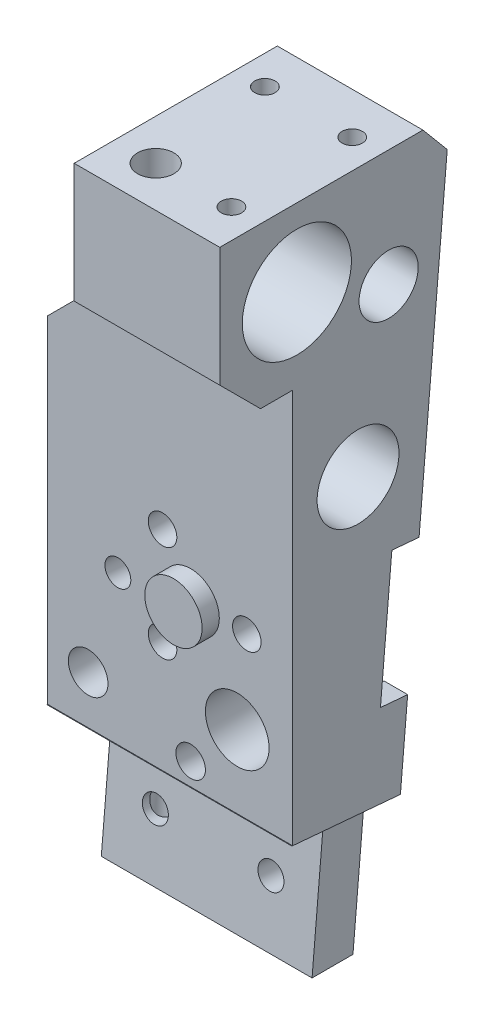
from build123d import *

# Parameters (mm, degrees)
SKETCH1_W                                           = 21.3868
SKETCH1_H                                           = 62.23
EXTRUDE1_DEPTH                                      = 13.716
CUT_EXTRUDE2_DEPTH                                  = 40.077480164
CUT_EXTRUDE2_DEPTH_BACK                             = 40.077480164
CUT_EXTRUDE3_DEPTH                                  = 40.077480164
CUT_EXTRUDE3_DEPTH_BACK                             = 40.077480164
CUT_EXTRUDE4_START                                  = -3
CUT_EXTRUDE4_DEPTH                                  = 3
CUT_EXTRUDE5_DEPTH                                  = 43.758328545
SKETCH10_W                                          = 21.3868
SKETCH10_H                                          = 13.97
EXTRUDE2_DEPTH                                      = 6.35
SKETCH13_R                                          = 1.4986
CUT_EXTRUDE9_DEPTH                                  = 46.197238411
SKETCH20_W                                          = 8.6868
SKETCH20_H                                          = 20.066
CUT_EXTRUDE10_DEPTH                                 = 13.97
SKETCH21_R                                          = 4.75869
CUT_EXTRUDE11_DEPTH                                 = 42.793362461
F_5_40_TAPPED_HOLE1_D                               = 2.5781
F_5_40_TAPPED_HOLE1_DEPTH                           = 10.033
F_5_40_TAPPED_HOLE1_TIP                             = 0.774539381
F_4_40_TAPPED_HOLE1_D                               = 2.2606
SKETCH26_R                                          = 2.50063
EXTRUDE4_DEPTH                                      = 1.5
CBORE_FOR_3_FILLISTER_HEAD_MACHINE_SCRE_D           = 2.4892
CBORE_FOR_3_FILLISTER_HEAD_MACHINE_SCRE_CBORE_D     = 4.4704
CBORE_FOR_3_FILLISTER_HEAD_MACHINE_SCRE_CBORE_DEPTH = 10.668
F_4_40_TAPPED_HOLE2_D                               = 2.2606
F_1_8_0_125_DIAMETER_HOLE1_D                        = 3.16738
F_1_8_0_125_DIAMETER_HOLE1_DEPTH                    = 4.572
F_2_56_TAPPED_HOLE1_D                               = 1.778
F_2_56_TAPPED_HOLE1_DEPTH                           = 3.9116
F_2_56_TAPPED_HOLE1_TIP                             = 0.53416509
F_8_32_TAPPED_HOLE1_D                               = 3.4544
EXTRUDE5_DEPTH                                      = 0.635
SKETCH44_W                                          = 21.3868
SKETCH44_H                                          = 0.632583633
CUT_EXTRUDE12_DEPTH                                 = 40.077480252
F_9_32_0_28125_DIAMETER_HOLE1_D                     = 7.14375
F_13_64_0_20313_DIAMETER_HOLE1_D                    = 5.159502
CHAMFER1_SIZE                                       = 5.08
CHAMFER2_SIZE                                       = 2.54
CHAMFER2_SIZE2                                      = 2.34457836
CHAMFER3_SIZE                                       = 3.556
CUT_EXTRUDE13_DEPTH                                 = 46.197238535
SKETCH58_R                                          = 2.77876
CUT_EXTRUDE14_DEPTH                                 = 40.000329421
SKETCH61_R                                          = 1.143
CUT_EXTRUDE15_DEPTH                                 = 0.381
F_4_40_TAPPED_HOLE5_D                               = 2.2606
F_4_40_TAPPED_HOLE5_DEPTH                           = 13.9446
F_4_40_TAPPED_HOLE5_TIP                             = 0.679152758


with BuildPart() as part:
    # Sketch1 → Extrude1 (new body)
    with BuildSketch(Plane.XY):
        with Locations((-1.8034, 3.27614406)):
            Rectangle(SKETCH1_W, SKETCH1_H)
    extrude(amount=EXTRUDE1_DEPTH)

    # Sketch2 → Cut-Extrude2 (cut, two sides: drawn at the far end of the back side and taken through both)
    with BuildSketch(Plane(origin=(0, 0, 0), x_dir=(0, 0, -1), z_dir=(1, 0, 0)).offset(-CUT_EXTRUDE2_DEPTH_BACK)):
        Polygon((0, 34.39114406), (0, -27.83885594), (-5.444419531, -27.83885594), align=None)
    extrude(amount=CUT_EXTRUDE2_DEPTH + CUT_EXTRUDE2_DEPTH_BACK, mode=Mode.SUBTRACT)

    # Sketch4 → Cut-Extrude3 (cut, two sides: drawn at the far end of the back side and taken through both)
    with BuildSketch(Plane(origin=(0, 0, 0), x_dir=(0, 0, -1), z_dir=(1, 0, 0)).offset(-CUT_EXTRUDE3_DEPTH_BACK)):
        Polygon((-9.014002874, -27.83885594), (-13.716, -27.83885594), (-13.716, -13.36085594), (-7.792680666, -13.879079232), align=None)
    extrude(amount=CUT_EXTRUDE3_DEPTH + CUT_EXTRUDE3_DEPTH_BACK, mode=Mode.SUBTRACT)

    # Sketch9 → Cut-Extrude4 (cut)
    with BuildSketch(Plane(origin=(8.89, 0, 0), x_dir=(0, 0, -1), z_dir=(1, 0, 0)).offset(CUT_EXTRUDE4_START)):
        Polygon((-5.444419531, -27.83885594), (-9.014002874, -27.83885594), (-7.792680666, -13.879079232), (-4.25021232, -14.189005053), align=None)
    extrude(amount=CUT_EXTRUDE4_DEPTH, mode=Mode.SUBTRACT)

    # Sketch8 → Cut-Extrude5 (cut, through all)
    with BuildSketch(Plane.ZY.offset(12.4968)):
        Polygon((3.673414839, -7.596179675), (2.677224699, 3.790325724), (5.049413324, 3.997865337), (6.045603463, -7.388640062), align=None)
    extrude(amount=-CUT_EXTRUDE5_DEPTH, mode=Mode.SUBTRACT)

    # Sketch10 → Extrude2 (add)
    with BuildSketch(Plane.XY.offset(13.716)):
        with Locations((-1.8034, 27.40614406)):
            Rectangle(SKETCH10_W, SKETCH10_H)
    extrude(amount=EXTRUDE2_DEPTH)

    # Sketch13 → Cut-Extrude9 (cut, through all)
    with BuildSketch(Plane(origin=(8.89, 0, 0), x_dir=(0, 0, -1), z_dir=(1, 0, 0))):
        with Locations(Location((-13.338597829, 27.646431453, 0), (0, 0, 90))):
            Circle(SKETCH13_R)
    extrude(amount=-CUT_EXTRUDE9_DEPTH, mode=Mode.SUBTRACT)

    # Sketch20 → Cut-Extrude10 (cut)
    with BuildSketch(Plane(origin=(0, 34.39114406, 0), x_dir=(-1, 0, 0), z_dir=(0, 1, 0))):
        with Locations((8.1534, 10.033)):
            Rectangle(SKETCH20_W, SKETCH20_H)
    extrude(amount=-CUT_EXTRUDE10_DEPTH, mode=Mode.SUBTRACT)

    # Sketch21 → Cut-Extrude11 (cut, through all)
    with BuildSketch(Plane.ZY.offset(3.81)):
        with Locations((13.338597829, 27.646431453)):
            Circle(SKETCH21_R)
    extrude(amount=-CUT_EXTRUDE11_DEPTH, mode=Mode.SUBTRACT)

    # 5-40 Tapped Hole1
    with Locations(Plane(origin=(0, 0.261239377, 2.985979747), x_dir=(-1, 0, 0), z_dir=(0, -0.08715574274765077, -0.9961946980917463))):
        with Locations((0, 16.792566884), (0, -13.207433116)):
            Hole(F_5_40_TAPPED_HOLE1_D / 2, depth=F_5_40_TAPPED_HOLE1_DEPTH)
            with Locations((0, 0, -(F_5_40_TAPPED_HOLE1_DEPTH + F_5_40_TAPPED_HOLE1_TIP / 2))):  # 118° drill point
                Cone(0, F_5_40_TAPPED_HOLE1_D / 2, F_5_40_TAPPED_HOLE1_TIP, mode=Mode.SUBTRACT)

    # 4-40 Tapped Hole1 (through all)
    with Locations(Plane(origin=(0, 0.571165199, 6.528448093), x_dir=(1, 0, 0), z_dir=(0, 0.08715574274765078, 0.9961946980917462))):
        with Locations((-8.258, -23.033098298), (1.826, -23.033098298)):
            Hole(F_4_40_TAPPED_HOLE1_D / 2)

    # Sketch26 → Extrude4 (add)
    with BuildSketch(Plane.XY.offset(13.716)):
        Circle(SKETCH26_R)
    extrude(amount=EXTRUDE4_DEPTH)

    # CBORE for _3 Fillister Head Machine Scre (through all)
    with Locations(Plane(origin=(0, 0, 0), x_dir=(1, 0, 0), z_dir=(0, 0, -1))):
        with Locations((-2.45, 4.243524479), (-2.45, -4.243524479), (4.9, 0)):
            CounterBoreHole(CBORE_FOR_3_FILLISTER_HEAD_MACHINE_SCRE_D / 2, CBORE_FOR_3_FILLISTER_HEAD_MACHINE_SCRE_CBORE_D / 2, CBORE_FOR_3_FILLISTER_HEAD_MACHINE_SCRE_CBORE_DEPTH)

    # 4-40 Tapped Hole2 (through all)
    with Locations(Plane(origin=(0, 0.46877899, 5.358168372), x_dir=(-1, 0, 0), z_dir=(0, -0.08715574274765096, -0.9961946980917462))):
        with Locations((6.35, -2.172433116)):
            Hole(F_4_40_TAPPED_HOLE2_D / 2)

    # 1_8 _0.125_ Diameter Hole1
    with Locations(Plane(origin=(0, 34.39114406, 0), x_dir=(-1, 0, 0), z_dir=(0, 1, 0))):
        with Locations((0.254, 16.51)):
            Hole(F_1_8_0_125_DIAMETER_HOLE1_D / 2, depth=F_1_8_0_125_DIAMETER_HOLE1_DEPTH)

    # 2-56 Tapped Hole1
    with Locations(Plane(origin=(0, 34.39114406, 0), x_dir=(-1, 0, 0), z_dir=(0, 1, 0))):
        with Locations((1.27, 5.969), (-6.35, 5.969), (-6.35, 16.51)):
            Hole(F_2_56_TAPPED_HOLE1_D / 2, depth=F_2_56_TAPPED_HOLE1_DEPTH)
            with Locations((0, 0, -(F_2_56_TAPPED_HOLE1_DEPTH + F_2_56_TAPPED_HOLE1_TIP / 2))):  # 118° drill point
                Cone(0, F_2_56_TAPPED_HOLE1_D / 2, F_2_56_TAPPED_HOLE1_TIP, mode=Mode.SUBTRACT)

    # 8-32 Tapped Hole1 (through all)
    with Locations(Plane.XY.offset(13.716)):
        with Locations((-8.9408, -9.80485594)):
            Hole(F_8_32_TAPPED_HOLE1_D / 2)

    # Sketch43 → Extrude5 (add)
    with BuildSketch(Plane(origin=(0, -14.450244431, 1.264232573), x_dir=(1, 0, 0), z_dir=(0, -0.9961946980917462, 0.0871557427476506))):
        Polygon((8.89, 12.499331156), (-12.4968, 12.499331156), (-12.4968, 6.553385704), (5.89, 6.553385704), (5.89, 2.997385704), (8.89, 2.997385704), align=None)
    extrude(amount=EXTRUDE5_DEPTH)

    # Sketch44 → Cut-Extrude12 (cut, through all)
    with BuildSketch(Plane.XY.offset(13.716)):
        with Locations((-1.8034, -13.677147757)):
            Rectangle(SKETCH44_W, SKETCH44_H)
    extrude(amount=CUT_EXTRUDE12_DEPTH, mode=Mode.SUBTRACT)

    # 9_32 _0.28125_ Diameter Hole1 (through all)
    with Locations(Plane(origin=(8.89, 0, 0), x_dir=(0, 0, -1), z_dir=(1, 0, 0))):
        with Locations((-8.001, 11.02314406)):
            Hole(F_9_32_0_28125_DIAMETER_HOLE1_D / 2)

    # 13_64 _0.20313_ Diameter Hole1 (through all)
    with Locations(Plane.ZY.offset(3.81)):
        with Locations((5.334, 24.23114406)):
            Hole(F_13_64_0_20313_DIAMETER_HOLE1_D / 2)

    # Chamfer1
    chamfer1_edges = [part.edges().sort_by_distance(p)[0] for p in [
        (-12.4968, 20.42114406, 7.469108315),
    ]]
    chamfer(chamfer1_edges, length=CHAMFER1_SIZE)

    # Chamfer2
    chamfer2_edges = [part.edges().sort_by_distance(p)[0] for p in [
        (2.54, 34.39114406, 0),
    ]]
    chamfer2_side = [part.faces().sort_by_distance(p)[0] for p in [
        (-12.122504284, 9.565734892, 2.17194187),
    ]]
    chamfer(chamfer2_edges, length=CHAMFER2_SIZE, length2=CHAMFER2_SIZE2, reference=chamfer2_side[0])

    # Chamfer3
    chamfer3_edges = [part.edges().sort_by_distance(p)[0] for p in [
        (2.54, 20.42114406, 20.066),
    ]]
    chamfer(chamfer3_edges, length=CHAMFER3_SIZE)

    # Sketch56 → Cut-Extrude13 (cut, through all)
    with BuildSketch(Plane.ZY.offset(12.4968)):
        Polygon((2.677224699, 3.790325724), (5.051943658, 3.998086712), (6.048133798, -7.388418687), (3.673414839, -7.596179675), align=None)
    extrude(amount=-CUT_EXTRUDE13_DEPTH, mode=Mode.SUBTRACT)

    # Sketch58 → Cut-Extrude14 (cut, through all)
    with BuildSketch(Plane.XY.offset(13.716)):
        with Locations((4.064, -7.643439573)):
            Circle(SKETCH58_R)
    extrude(amount=-CUT_EXTRUDE14_DEPTH, mode=Mode.SUBTRACT)

    # Sketch61 → Cut-Extrude15 (cut)
    with BuildSketch(Plane(origin=(0, -28.410021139, 2.48555478), x_dir=(-1, 0, 0), z_dir=(0, 0.9961946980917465, -0.08715574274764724))):
        with Locations(Location((9.3218, 4.775385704, 0), (0, 0, 90))):
            Circle(SKETCH61_R)
    extrude(amount=CUT_EXTRUDE15_DEPTH, mode=Mode.SUBTRACT)

    # 4-40 Tapped Hole5
    with Locations(Plane(origin=(-9.329744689, -27.614388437, 7.208193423), x_dir=(0, -0.087155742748, -0.996194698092), z_dir=(0, -0.996194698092, 0.087155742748))):
        with Locations((0, 0)):
            Hole(F_4_40_TAPPED_HOLE5_D / 2, depth=F_4_40_TAPPED_HOLE5_DEPTH)
            with Locations((0, 0, -(F_4_40_TAPPED_HOLE5_DEPTH + F_4_40_TAPPED_HOLE5_TIP / 2))):  # 118° drill point
                Cone(0, F_4_40_TAPPED_HOLE5_D / 2, F_4_40_TAPPED_HOLE5_TIP, mode=Mode.SUBTRACT)


solid = part.part
